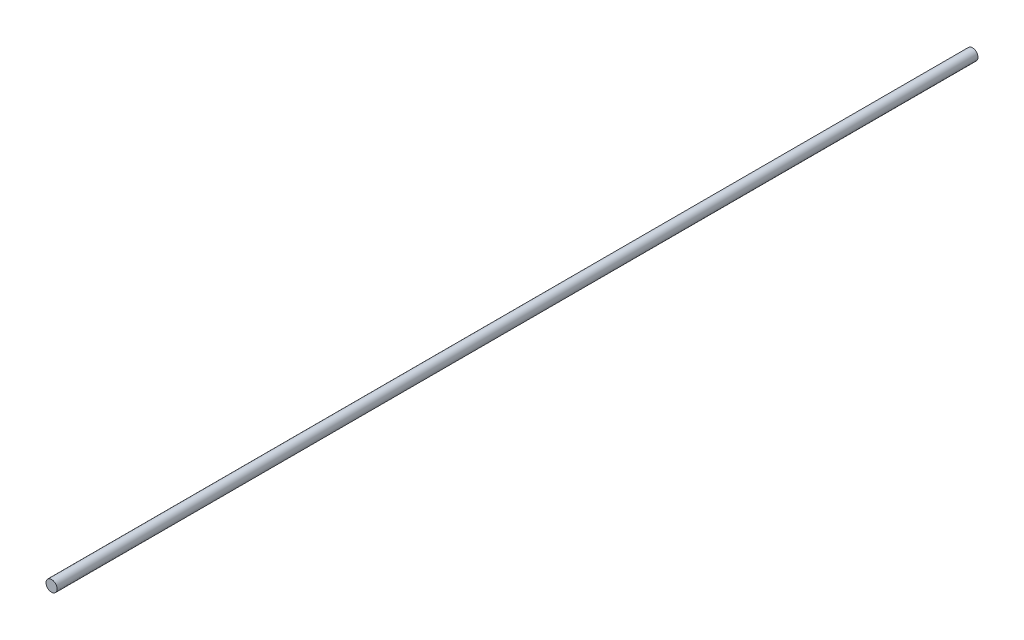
from build123d import *

# Parameters (mm, degrees)
SKETCH1_R      = 6.35
EXTRUDE1_DEPTH = 1054.1


with BuildPart() as part:
    # Sketch1 → Extrude1 (new body)
    with BuildSketch(Plane.XY):
        Circle(SKETCH1_R)
    extrude(amount=EXTRUDE1_DEPTH)


solid = part.part
